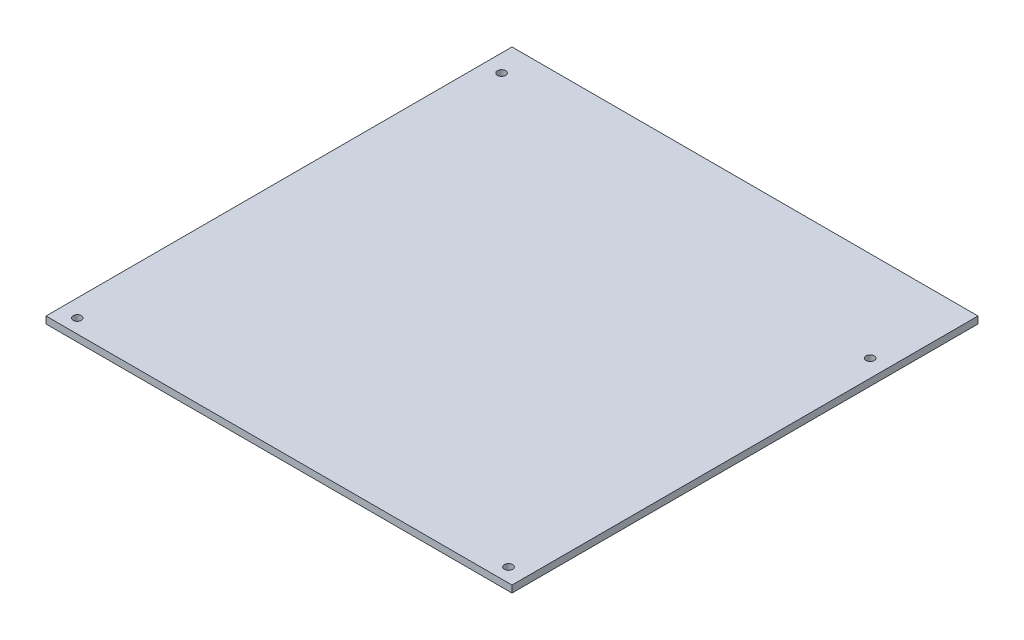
from build123d import *

# Parameters (mm, degrees)
SKETCH1_W                    = 170.18
SKETCH1_H                    = 170.18
EXTRUDE1_DEPTH               = 2.54
F_3_0_3_DIAMETER_HOLE1_D     = 3
F_3_0_3_DIAMETER_HOLE1_DEPTH = 3.048
F_3_0_3_DIAMETER_HOLE1_TIP   = 0.901290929


with BuildPart() as part:
    # Sketch1 → Extrude1 (new body)
    with BuildSketch(Plane(origin=(0, 0, 0), x_dir=(1, 0, 0), z_dir=(0, 1, 0))):
        with Locations((0, 85.09)):
            Rectangle(SKETCH1_W, SKETCH1_H)
    extrude(amount=EXTRUDE1_DEPTH)

    # 3.0 _3_ Diameter Hole1
    with Locations(Plane(origin=(0, 2.54, 0), x_dir=(1, 0, 0), z_dir=(0, 1, 0))):
        with Locations((-78.74, 160.02), (-33.02, -67.31), (78.74, 137.16), (78.74, 5.08), (-78.74, 5.08)):
            Hole(F_3_0_3_DIAMETER_HOLE1_D / 2, depth=F_3_0_3_DIAMETER_HOLE1_DEPTH)
            with Locations((0, 0, -(F_3_0_3_DIAMETER_HOLE1_DEPTH + F_3_0_3_DIAMETER_HOLE1_TIP / 2))):  # 118° drill point
                Cone(0, F_3_0_3_DIAMETER_HOLE1_D / 2, F_3_0_3_DIAMETER_HOLE1_TIP, mode=Mode.SUBTRACT)


solid = part.part
